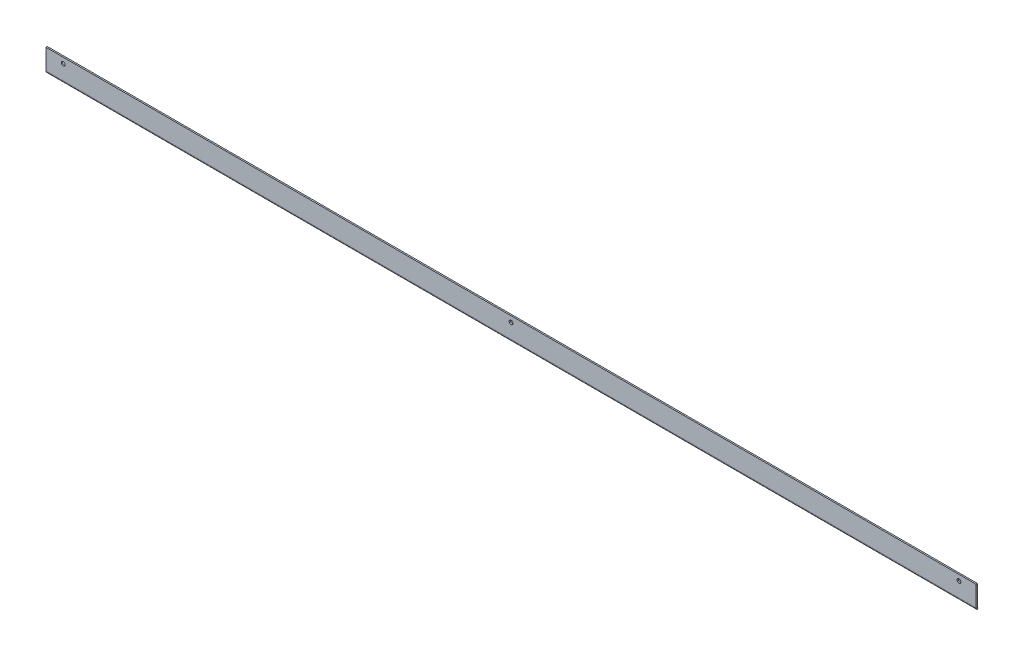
ISO-10303-21;
HEADER;
FILE_DESCRIPTION(('STEP AP214'),'2;1');
FILE_NAME('part.step','',(''),(''),'','','');
FILE_SCHEMA(('AUTOMOTIVE_DESIGN { 1 0 10303 214 1 1 1 1 }'));
ENDSEC;
DATA;
#1=APPLICATION_CONTEXT('core data for automotive mechanical design processes');
#2=APPLICATION_PROTOCOL_DEFINITION('international standard','automotive_design',2000,#1);
#3=PRODUCT_CONTEXT('',#1,'mechanical');
#4=PRODUCT('Part','Part','',(#3));
#5=PRODUCT_RELATED_PRODUCT_CATEGORY('part','',(#4));
#6=PRODUCT_DEFINITION_FORMATION('','',#4);
#7=PRODUCT_DEFINITION_CONTEXT('part definition',#1,'design');
#8=PRODUCT_DEFINITION('design','',#6,#7);
#9=PRODUCT_DEFINITION_SHAPE('','',#8);
#10=(LENGTH_UNIT() NAMED_UNIT(*) SI_UNIT(.MILLI.,.METRE.));
#11=(NAMED_UNIT(*) PLANE_ANGLE_UNIT() SI_UNIT($,.RADIAN.));
#12=(NAMED_UNIT(*) SI_UNIT($,.STERADIAN.) SOLID_ANGLE_UNIT());
#13=UNCERTAINTY_MEASURE_WITH_UNIT(LENGTH_MEASURE(1.E-05),#10,'distance_accuracy_value','');
#14=(GEOMETRIC_REPRESENTATION_CONTEXT(3) GLOBAL_UNCERTAINTY_ASSIGNED_CONTEXT((#13)) GLOBAL_UNIT_ASSIGNED_CONTEXT((#10,
#11,#12)) REPRESENTATION_CONTEXT('',''));
#15=CARTESIAN_POINT('',(0.,0.,0.));
#16=DIRECTION('',(0.,0.,1.));
#17=DIRECTION('',(1.,0.,0.));
#18=AXIS2_PLACEMENT_3D('',#15,#16,#17);
#19=CARTESIAN_POINT('',(405.9,-96.6000000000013,-1.00000000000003));
#20=DIRECTION('',(1.,0.,0.));
#21=DIRECTION('',(0.,0.,-1.));
#22=AXIS2_PLACEMENT_3D('',#19,#20,#21);
#23=PLANE('',#22);
#24=CARTESIAN_POINT('',(405.9,-96.6000000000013,-1.00000000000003));
#25=DIRECTION('',(-1.,0.,0.));
#26=DIRECTION('',(0.,0.,1.));
#27=AXIS2_PLACEMENT_3D('',#24,#25,#26);
#28=CIRCLE('',#27,2.19999999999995);
#29=CARTESIAN_POINT('',(405.9,-96.6000000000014,1.2));
#30=VERTEX_POINT('',#29);
#31=CARTESIAN_POINT('',(405.9,-98.4439088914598,0.200000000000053));
#32=VERTEX_POINT('',#31);
#33=EDGE_CURVE('E198',#30,#32,#28,.F.);
#34=ORIENTED_EDGE('',*,*,#33,.T.);
#35=DIRECTION('',(0.,-0.838140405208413,0.545454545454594));
#36=VECTOR('',#35,1.);
#37=CARTESIAN_POINT('',(405.9,-98.4439088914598,0.200000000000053));
#38=LINE('',#37,#36);
#39=CARTESIAN_POINT('',(405.9,-97.4381404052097,-0.454545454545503));
#40=VERTEX_POINT('',#39);
#41=EDGE_CURVE('E157',#32,#40,#38,.F.);
#42=ORIENTED_EDGE('',*,*,#41,.T.);
#43=CARTESIAN_POINT('',(405.9,-96.6000000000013,-1.00000000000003));
#44=DIRECTION('',(-1.,0.,0.));
#45=DIRECTION('',(0.,0.,1.));
#46=AXIS2_PLACEMENT_3D('',#43,#44,#45);
#47=CIRCLE('',#46,0.999999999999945);
#48=CARTESIAN_POINT('',(405.9,-96.6000000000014,0.));
#49=VERTEX_POINT('',#48);
#50=EDGE_CURVE('E204',#49,#40,#47,.F.);
#51=ORIENTED_EDGE('',*,*,#50,.F.);
#52=DIRECTION('',(0.,0.,1.));
#53=VECTOR('',#52,1.);
#54=CARTESIAN_POINT('',(405.9,-96.6000000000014,0.));
#55=LINE('',#54,#53);
#56=EDGE_CURVE('E211',#49,#30,#55,.T.);
#57=ORIENTED_EDGE('',*,*,#56,.T.);
#58=EDGE_LOOP('',(#34,#42,#51,#57));
#59=FACE_BOUND('',#58,.T.);
#60=ADVANCED_FACE('F61',(#59),#23,.T.);
#61=CARTESIAN_POINT('',(-406.9,-96.6000000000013,-0.999999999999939));
#62=DIRECTION('',(1.,0.,0.));
#63=DIRECTION('',(0.,0.,-1.));
#64=AXIS2_PLACEMENT_3D('',#61,#62,#63);
#65=PLANE('',#64);
#66=CARTESIAN_POINT('',(-406.9,-96.6000000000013,-0.999999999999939));
#67=DIRECTION('',(-1.,0.,0.));
#68=DIRECTION('',(0.,0.,1.));
#69=AXIS2_PLACEMENT_3D('',#66,#67,#68);
#70=CIRCLE('',#69,0.999999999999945);
#71=CARTESIAN_POINT('',(-406.9,-97.4381404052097,-0.454545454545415));
#72=VERTEX_POINT('',#71);
#73=CARTESIAN_POINT('',(-406.9,-96.6000000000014,0.));
#74=VERTEX_POINT('',#73);
#75=EDGE_CURVE('E209',#72,#74,#70,.T.);
#76=ORIENTED_EDGE('',*,*,#75,.F.);
#77=DIRECTION('',(0.,-0.838140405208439,0.545454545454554));
#78=VECTOR('',#77,1.);
#79=CARTESIAN_POINT('',(-406.9,-98.4439088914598,0.200000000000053));
#80=LINE('',#79,#78);
#81=CARTESIAN_POINT('',(-406.9,-98.4439088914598,0.200000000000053));
#82=VERTEX_POINT('',#81);
#83=EDGE_CURVE('E270',#82,#72,#80,.F.);
#84=ORIENTED_EDGE('',*,*,#83,.F.);
#85=CARTESIAN_POINT('',(-406.9,-96.6000000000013,-0.999999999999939));
#86=DIRECTION('',(-1.,0.,0.));
#87=DIRECTION('',(0.,0.,1.));
#88=AXIS2_PLACEMENT_3D('',#85,#86,#87);
#89=CIRCLE('',#88,2.19999999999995);
#90=CARTESIAN_POINT('',(-406.9,-96.6000000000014,1.20000000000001));
#91=VERTEX_POINT('',#90);
#92=EDGE_CURVE('E199',#82,#91,#89,.T.);
#93=ORIENTED_EDGE('',*,*,#92,.T.);
#94=DIRECTION('',(0.,0.,1.));
#95=VECTOR('',#94,1.);
#96=CARTESIAN_POINT('',(-406.9,-96.6000000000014,0.));
#97=LINE('',#96,#95);
#98=EDGE_CURVE('E202',#74,#91,#97,.T.);
#99=ORIENTED_EDGE('',*,*,#98,.F.);
#100=EDGE_LOOP('',(#76,#84,#93,#99));
#101=FACE_BOUND('',#100,.T.);
#102=ADVANCED_FACE('F312',(#101),#65,.F.);
#103=CARTESIAN_POINT('',(-406.9,-96.6000000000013,-0.999999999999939));
#104=DIRECTION('',(-1.,0.,0.));
#105=DIRECTION('',(0.,-1.,0.));
#106=AXIS2_PLACEMENT_3D('',#103,#104,#105);
#107=CYLINDRICAL_SURFACE('',#106,2.19999999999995);
#108=CARTESIAN_POINT('',(391.9,-96.6000000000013,-1.00000000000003));
#109=DIRECTION('',(-1.,0.,0.));
#110=DIRECTION('',(0.,-1.,0.));
#111=AXIS2_PLACEMENT_3D('',#108,#109,#110);
#112=CIRCLE('',#111,2.19999999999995);
#113=CARTESIAN_POINT('',(391.9,-98.4439088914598,0.200000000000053));
#114=VERTEX_POINT('',#113);
#115=CARTESIAN_POINT('',(391.9,-98.8000000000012,-0.999999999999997));
#116=VERTEX_POINT('',#115);
#117=EDGE_CURVE('E161',#114,#116,#112,.F.);
#118=ORIENTED_EDGE('',*,*,#117,.F.);
#119=DIRECTION('',(-1.,0.,0.));
#120=VECTOR('',#119,1.);
#121=CARTESIAN_POINT('',(-406.9,-98.4439088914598,0.200000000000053));
#122=LINE('',#121,#120);
#123=EDGE_CURVE('E169',#32,#114,#122,.T.);
#124=ORIENTED_EDGE('',*,*,#123,.F.);
#125=ORIENTED_EDGE('',*,*,#33,.F.);
#126=DIRECTION('',(-1.,0.,0.));
#127=VECTOR('',#126,1.);
#128=CARTESIAN_POINT('',(-406.9,-96.6000000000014,1.20000000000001));
#129=LINE('',#128,#127);
#130=EDGE_CURVE('E195',#91,#30,#129,.F.);
#131=ORIENTED_EDGE('',*,*,#130,.F.);
#132=ORIENTED_EDGE('',*,*,#92,.F.);
#133=DIRECTION('',(-1.,0.,0.));
#134=VECTOR('',#133,1.);
#135=CARTESIAN_POINT('',(-406.9,-98.4439088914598,0.200000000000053));
#136=LINE('',#135,#134);
#137=CARTESIAN_POINT('',(-392.9,-98.4439088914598,0.200000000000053));
#138=VERTEX_POINT('',#137);
#139=EDGE_CURVE('E262',#138,#82,#136,.T.);
#140=ORIENTED_EDGE('',*,*,#139,.F.);
#141=CARTESIAN_POINT('',(-392.9,-96.6000000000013,-0.99999999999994));
#142=DIRECTION('',(1.,0.,0.));
#143=DIRECTION('',(0.,1.,0.));
#144=AXIS2_PLACEMENT_3D('',#141,#142,#143);
#145=CIRCLE('',#144,2.19999999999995);
#146=CARTESIAN_POINT('',(-392.9,-98.8000000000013,-0.999999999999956));
#147=VERTEX_POINT('',#146);
#148=EDGE_CURVE('E184',#147,#138,#145,.F.);
#149=ORIENTED_EDGE('',*,*,#148,.F.);
#150=DIRECTION('',(-1.,0.,0.));
#151=VECTOR('',#150,1.);
#152=CARTESIAN_POINT('',(0.,-98.8000000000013,-0.999999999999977));
#153=LINE('',#152,#151);
#154=EDGE_CURVE('E176',#116,#147,#153,.T.);
#155=ORIENTED_EDGE('',*,*,#154,.F.);
#156=EDGE_LOOP('',(#118,#124,#125,#131,#132,#140,#149,#155));
#157=FACE_BOUND('',#156,.T.);
#158=ADVANCED_FACE('F182',(#157),#107,.T.);
#159=CARTESIAN_POINT('',(-406.9,-96.6000000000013,-0.999999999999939));
#160=DIRECTION('',(-1.,0.,0.));
#161=DIRECTION('',(0.,-1.,0.));
#162=AXIS2_PLACEMENT_3D('',#159,#160,#161);
#163=CYLINDRICAL_SURFACE('',#162,0.999999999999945);
#164=DIRECTION('',(-1.,0.,0.));
#165=VECTOR('',#164,1.);
#166=CARTESIAN_POINT('',(-406.9,-97.4381404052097,-0.454545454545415));
#167=LINE('',#166,#165);
#168=CARTESIAN_POINT('',(391.9,-97.4381404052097,-0.454545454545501));
#169=VERTEX_POINT('',#168);
#170=EDGE_CURVE('E168',#40,#169,#167,.T.);
#171=ORIENTED_EDGE('',*,*,#170,.T.);
#172=CARTESIAN_POINT('',(391.9,-96.6000000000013,-1.00000000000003));
#173=DIRECTION('',(-1.,0.,0.));
#174=DIRECTION('',(0.,0.,1.));
#175=AXIS2_PLACEMENT_3D('',#172,#173,#174);
#176=CIRCLE('',#175,0.999999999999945);
#177=CARTESIAN_POINT('',(391.9,-97.6000000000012,-1.00000000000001));
#178=VERTEX_POINT('',#177);
#179=EDGE_CURVE('E254',#169,#178,#176,.F.);
#180=ORIENTED_EDGE('',*,*,#179,.T.);
#181=DIRECTION('',(1.,0.,0.));
#182=VECTOR('',#181,1.);
#183=CARTESIAN_POINT('',(405.9,-97.6000000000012,-1.));
#184=LINE('',#183,#182);
#185=CARTESIAN_POINT('',(-392.9,-97.6000000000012,-0.999999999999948));
#186=VERTEX_POINT('',#185);
#187=EDGE_CURVE('E186',#178,#186,#184,.F.);
#188=ORIENTED_EDGE('',*,*,#187,.T.);
#189=CARTESIAN_POINT('',(-392.9,-96.6000000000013,-0.99999999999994));
#190=DIRECTION('',(-1.,0.,0.));
#191=DIRECTION('',(0.,0.,1.));
#192=AXIS2_PLACEMENT_3D('',#189,#190,#191);
#193=CIRCLE('',#192,0.999999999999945);
#194=CARTESIAN_POINT('',(-392.9,-97.4381404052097,-0.454545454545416));
#195=VERTEX_POINT('',#194);
#196=EDGE_CURVE('E258',#186,#195,#193,.T.);
#197=ORIENTED_EDGE('',*,*,#196,.T.);
#198=DIRECTION('',(-1.,0.,0.));
#199=VECTOR('',#198,1.);
#200=CARTESIAN_POINT('',(-406.9,-97.4381404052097,-0.454545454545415));
#201=LINE('',#200,#199);
#202=EDGE_CURVE('E261',#195,#72,#201,.T.);
#203=ORIENTED_EDGE('',*,*,#202,.T.);
#204=ORIENTED_EDGE('',*,*,#75,.T.);
#205=DIRECTION('',(-1.,0.,0.));
#206=VECTOR('',#205,1.);
#207=CARTESIAN_POINT('',(-406.9,-96.6000000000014,0.));
#208=LINE('',#207,#206);
#209=EDGE_CURVE('E207',#74,#49,#208,.F.);
#210=ORIENTED_EDGE('',*,*,#209,.T.);
#211=ORIENTED_EDGE('',*,*,#50,.T.);
#212=EDGE_LOOP('',(#171,#180,#188,#197,#203,#204,#210,#211));
#213=FACE_BOUND('',#212,.T.);
#214=ADVANCED_FACE('F246',(#213),#163,.F.);
#215=CARTESIAN_POINT('',(0.,-98.8000000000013,3.02260524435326E-13));
#216=DIRECTION('',(0.,-1.,0.));
#217=DIRECTION('',(0.,0.,-1.));
#218=AXIS2_PLACEMENT_3D('',#215,#216,#217);
#219=PLANE('',#218);
#220=DIRECTION('',(-1.,0.,0.));
#221=VECTOR('',#220,1.);
#222=CARTESIAN_POINT('',(-406.9,-98.8000000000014,-13.8));
#223=LINE('',#222,#221);
#224=CARTESIAN_POINT('',(391.9,-98.8000000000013,-13.8));
#225=VERTEX_POINT('',#224);
#226=CARTESIAN_POINT('',(-392.9,-98.8000000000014,-13.8));
#227=VERTEX_POINT('',#226);
#228=EDGE_CURVE('E178',#225,#227,#223,.T.);
#229=ORIENTED_EDGE('',*,*,#228,.F.);
#230=DIRECTION('',(0.,0.,1.));
#231=VECTOR('',#230,1.);
#232=CARTESIAN_POINT('',(391.9,-98.8000000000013,-13.8));
#233=LINE('',#232,#231);
#234=EDGE_CURVE('E76',#225,#116,#233,.T.);
#235=ORIENTED_EDGE('',*,*,#234,.T.);
#236=ORIENTED_EDGE('',*,*,#154,.T.);
#237=DIRECTION('',(0.,0.,-1.));
#238=VECTOR('',#237,1.);
#239=CARTESIAN_POINT('',(-392.9,-98.8000000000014,-7.39999999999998));
#240=LINE('',#239,#238);
#241=EDGE_CURVE('E156',#227,#147,#240,.F.);
#242=ORIENTED_EDGE('',*,*,#241,.F.);
#243=EDGE_LOOP('',(#229,#235,#236,#242));
#244=FACE_BOUND('',#243,.T.);
#245=ADVANCED_FACE('F174',(#244),#219,.T.);
#246=CARTESIAN_POINT('',(0.,-97.6000000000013,2.98070746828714E-13));
#247=DIRECTION('',(0.,-1.,0.));
#248=DIRECTION('',(0.,0.,-1.));
#249=AXIS2_PLACEMENT_3D('',#246,#247,#248);
#250=PLANE('',#249);
#251=DIRECTION('',(0.,0.,1.));
#252=VECTOR('',#251,1.);
#253=CARTESIAN_POINT('',(391.9,-97.6000000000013,-7.4));
#254=LINE('',#253,#252);
#255=CARTESIAN_POINT('',(391.9,-97.6000000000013,-13.8));
#256=VERTEX_POINT('',#255);
#257=EDGE_CURVE('E153',#256,#178,#254,.T.);
#258=ORIENTED_EDGE('',*,*,#257,.F.);
#259=DIRECTION('',(1.,0.,0.));
#260=VECTOR('',#259,1.);
#261=CARTESIAN_POINT('',(0.,-97.6000000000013,-13.8));
#262=LINE('',#261,#260);
#263=CARTESIAN_POINT('',(-392.9,-97.6000000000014,-13.8));
#264=VERTEX_POINT('',#263);
#265=EDGE_CURVE('E185',#256,#264,#262,.F.);
#266=ORIENTED_EDGE('',*,*,#265,.T.);
#267=DIRECTION('',(0.,0.,1.));
#268=VECTOR('',#267,1.);
#269=CARTESIAN_POINT('',(-392.9,-97.6000000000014,-13.8));
#270=LINE('',#269,#268);
#271=EDGE_CURVE('E84',#264,#186,#270,.T.);
#272=ORIENTED_EDGE('',*,*,#271,.T.);
#273=ORIENTED_EDGE('',*,*,#187,.F.);
#274=EDGE_LOOP('',(#258,#266,#272,#273));
#275=FACE_BOUND('',#274,.T.);
#276=ADVANCED_FACE('F302',(#275),#250,.F.);
#277=CARTESIAN_POINT('',(-406.9,-98.8000000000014,-13.8));
#278=DIRECTION('',(0.,0.,-1.));
#279=DIRECTION('',(0.,1.,0.));
#280=AXIS2_PLACEMENT_3D('',#277,#278,#279);
#281=PLANE('',#280);
#282=ORIENTED_EDGE('',*,*,#265,.F.);
#283=DIRECTION('',(0.,1.,0.));
#284=VECTOR('',#283,1.);
#285=CARTESIAN_POINT('',(391.9,-98.8000000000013,-13.8));
#286=LINE('',#285,#284);
#287=EDGE_CURVE('E179',#256,#225,#286,.F.);
#288=ORIENTED_EDGE('',*,*,#287,.T.);
#289=ORIENTED_EDGE('',*,*,#228,.T.);
#290=DIRECTION('',(0.,-1.,0.));
#291=VECTOR('',#290,1.);
#292=CARTESIAN_POINT('',(-392.9,-97.6000000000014,-13.8));
#293=LINE('',#292,#291);
#294=EDGE_CURVE('E266',#227,#264,#293,.F.);
#295=ORIENTED_EDGE('',*,*,#294,.T.);
#296=EDGE_LOOP('',(#282,#288,#289,#295));
#297=FACE_BOUND('',#296,.T.);
#298=ADVANCED_FACE('F292',(#297),#281,.T.);
#299=CARTESIAN_POINT('',(405.9,-98.8000000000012,1.2));
#300=DIRECTION('',(-1.,0.,0.));
#301=DIRECTION('',(0.,0.,1.));
#302=AXIS2_PLACEMENT_3D('',#299,#300,#301);
#303=PLANE('',#302);
#304=ORIENTED_EDGE('',*,*,#56,.F.);
#305=DIRECTION('',(0.,1.,0.));
#306=VECTOR('',#305,1.);
#307=CARTESIAN_POINT('',(405.9,-98.8000000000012,0.));
#308=LINE('',#307,#306);
#309=CARTESIAN_POINT('',(405.9,-78.8000000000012,0.));
#310=VERTEX_POINT('',#309);
#311=EDGE_CURVE('E214',#49,#310,#308,.T.);
#312=ORIENTED_EDGE('',*,*,#311,.T.);
#313=DIRECTION('',(0.,0.,-1.));
#314=VECTOR('',#313,1.);
#315=CARTESIAN_POINT('',(405.9,-78.8000000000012,1.2));
#316=LINE('',#315,#314);
#317=CARTESIAN_POINT('',(405.9,-78.8000000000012,1.2));
#318=VERTEX_POINT('',#317);
#319=EDGE_CURVE('E13',#318,#310,#316,.T.);
#320=ORIENTED_EDGE('',*,*,#319,.F.);
#321=DIRECTION('',(0.,1.,0.));
#322=VECTOR('',#321,1.);
#323=CARTESIAN_POINT('',(405.9,-98.8000000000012,1.2));
#324=LINE('',#323,#322);
#325=EDGE_CURVE('E217',#30,#318,#324,.T.);
#326=ORIENTED_EDGE('',*,*,#325,.F.);
#327=EDGE_LOOP('',(#304,#312,#320,#326));
#328=FACE_BOUND('',#327,.T.);
#329=ADVANCED_FACE('F63',(#328),#303,.F.);
#330=CARTESIAN_POINT('',(-406.9,-98.8000000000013,1.2));
#331=DIRECTION('',(1.,0.,0.));
#332=DIRECTION('',(0.,1.,0.));
#333=AXIS2_PLACEMENT_3D('',#330,#331,#332);
#334=PLANE('',#333);
#335=ORIENTED_EDGE('',*,*,#98,.T.);
#336=DIRECTION('',(0.,-1.,0.));
#337=VECTOR('',#336,1.);
#338=CARTESIAN_POINT('',(-406.9,-98.8000000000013,1.2));
#339=LINE('',#338,#337);
#340=CARTESIAN_POINT('',(-406.9,-78.8000000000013,1.2));
#341=VERTEX_POINT('',#340);
#342=EDGE_CURVE('E222',#341,#91,#339,.T.);
#343=ORIENTED_EDGE('',*,*,#342,.F.);
#344=DIRECTION('',(0.,0.,-1.));
#345=VECTOR('',#344,1.);
#346=CARTESIAN_POINT('',(-406.9,-78.8000000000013,1.2));
#347=LINE('',#346,#345);
#348=CARTESIAN_POINT('',(-406.9,-78.8000000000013,0.));
#349=VERTEX_POINT('',#348);
#350=EDGE_CURVE('E69',#341,#349,#347,.T.);
#351=ORIENTED_EDGE('',*,*,#350,.T.);
#352=DIRECTION('',(0.,-1.,0.));
#353=VECTOR('',#352,1.);
#354=CARTESIAN_POINT('',(-406.9,-98.8000000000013,0.));
#355=LINE('',#354,#353);
#356=EDGE_CURVE('E220',#349,#74,#355,.T.);
#357=ORIENTED_EDGE('',*,*,#356,.T.);
#358=EDGE_LOOP('',(#335,#343,#351,#357));
#359=FACE_BOUND('',#358,.T.);
#360=ADVANCED_FACE('F234',(#359),#334,.F.);
#361=CARTESIAN_POINT('',(0.,0.,1.2));
#362=DIRECTION('',(0.,0.,1.));
#363=DIRECTION('',(1.,0.,0.));
#364=AXIS2_PLACEMENT_3D('',#361,#362,#363);
#365=PLANE('',#364);
#366=CARTESIAN_POINT('',(390.9,-83.8000000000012,1.2));
#367=DIRECTION('',(0.,0.,1.));
#368=DIRECTION('',(1.,0.,0.));
#369=AXIS2_PLACEMENT_3D('',#366,#367,#368);
#370=CIRCLE('',#369,1.65000000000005);
#371=CARTESIAN_POINT('',(392.55,-83.8000000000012,1.2));
#372=VERTEX_POINT('',#371);
#373=EDGE_CURVE('E277',#372,#372,#370,.T.);
#374=ORIENTED_EDGE('',*,*,#373,.F.);
#375=EDGE_LOOP('',(#374));
#376=FACE_BOUND('',#375,.T.);
#377=CARTESIAN_POINT('',(-0.499999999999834,-83.8000000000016,1.2));
#378=DIRECTION('',(0.,0.,1.));
#379=DIRECTION('',(1.,0.,0.));
#380=AXIS2_PLACEMENT_3D('',#377,#378,#379);
#381=CIRCLE('',#380,1.65000000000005);
#382=CARTESIAN_POINT('',(1.15000000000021,-83.8000000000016,1.2));
#383=VERTEX_POINT('',#382);
#384=EDGE_CURVE('E283',#383,#383,#381,.T.);
#385=ORIENTED_EDGE('',*,*,#384,.F.);
#386=EDGE_LOOP('',(#385));
#387=FACE_BOUND('',#386,.T.);
#388=CARTESIAN_POINT('',(-391.9,-83.8000000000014,1.2));
#389=DIRECTION('',(0.,0.,1.));
#390=DIRECTION('',(1.,0.,0.));
#391=AXIS2_PLACEMENT_3D('',#388,#389,#390);
#392=CIRCLE('',#391,1.65000000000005);
#393=CARTESIAN_POINT('',(-390.25,-83.8000000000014,1.2));
#394=VERTEX_POINT('',#393);
#395=EDGE_CURVE('E272',#394,#394,#392,.T.);
#396=ORIENTED_EDGE('',*,*,#395,.F.);
#397=EDGE_LOOP('',(#396));
#398=FACE_BOUND('',#397,.T.);
#399=ORIENTED_EDGE('',*,*,#342,.T.);
#400=ORIENTED_EDGE('',*,*,#130,.T.);
#401=ORIENTED_EDGE('',*,*,#325,.T.);
#402=DIRECTION('',(-1.,0.,0.));
#403=VECTOR('',#402,1.);
#404=CARTESIAN_POINT('',(405.9,-78.8000000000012,1.2));
#405=LINE('',#404,#403);
#406=EDGE_CURVE('E219',#318,#341,#405,.T.);
#407=ORIENTED_EDGE('',*,*,#406,.T.);
#408=EDGE_LOOP('',(#399,#400,#401,#407));
#409=FACE_BOUND('',#408,.T.);
#410=ADVANCED_FACE('F322',(#376,#387,#398,#409),#365,.T.);
#411=CARTESIAN_POINT('',(0.,0.,0.));
#412=DIRECTION('',(0.,0.,1.));
#413=DIRECTION('',(1.,0.,0.));
#414=AXIS2_PLACEMENT_3D('',#411,#412,#413);
#415=PLANE('',#414);
#416=CARTESIAN_POINT('',(390.9,-83.8000000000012,0.));
#417=DIRECTION('',(0.,0.,1.));
#418=DIRECTION('',(1.,0.,0.));
#419=AXIS2_PLACEMENT_3D('',#416,#417,#418);
#420=CIRCLE('',#419,1.65000000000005);
#421=CARTESIAN_POINT('',(392.55,-83.8000000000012,0.));
#422=VERTEX_POINT('',#421);
#423=EDGE_CURVE('E191',#422,#422,#420,.T.);
#424=ORIENTED_EDGE('',*,*,#423,.T.);
#425=EDGE_LOOP('',(#424));
#426=FACE_BOUND('',#425,.T.);
#427=CARTESIAN_POINT('',(-0.499999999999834,-83.8000000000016,0.));
#428=DIRECTION('',(0.,0.,1.));
#429=DIRECTION('',(1.,0.,0.));
#430=AXIS2_PLACEMENT_3D('',#427,#428,#429);
#431=CIRCLE('',#430,1.65000000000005);
#432=CARTESIAN_POINT('',(1.15000000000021,-83.8000000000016,0.));
#433=VERTEX_POINT('',#432);
#434=EDGE_CURVE('E280',#433,#433,#431,.T.);
#435=ORIENTED_EDGE('',*,*,#434,.T.);
#436=EDGE_LOOP('',(#435));
#437=FACE_BOUND('',#436,.T.);
#438=CARTESIAN_POINT('',(-391.9,-83.8000000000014,0.));
#439=DIRECTION('',(0.,0.,1.));
#440=DIRECTION('',(1.,0.,0.));
#441=AXIS2_PLACEMENT_3D('',#438,#439,#440);
#442=CIRCLE('',#441,1.65000000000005);
#443=CARTESIAN_POINT('',(-390.25,-83.8000000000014,0.));
#444=VERTEX_POINT('',#443);
#445=EDGE_CURVE('E286',#444,#444,#442,.T.);
#446=ORIENTED_EDGE('',*,*,#445,.T.);
#447=EDGE_LOOP('',(#446));
#448=FACE_BOUND('',#447,.T.);
#449=ORIENTED_EDGE('',*,*,#209,.F.);
#450=ORIENTED_EDGE('',*,*,#356,.F.);
#451=DIRECTION('',(-1.,0.,0.));
#452=VECTOR('',#451,1.);
#453=CARTESIAN_POINT('',(405.9,-78.8000000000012,0.));
#454=LINE('',#453,#452);
#455=EDGE_CURVE('E226',#310,#349,#454,.T.);
#456=ORIENTED_EDGE('',*,*,#455,.F.);
#457=ORIENTED_EDGE('',*,*,#311,.F.);
#458=EDGE_LOOP('',(#449,#450,#456,#457));
#459=FACE_BOUND('',#458,.T.);
#460=ADVANCED_FACE('F240',(#426,#437,#448,#459),#415,.F.);
#461=CARTESIAN_POINT('',(405.9,-78.8000000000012,1.2));
#462=DIRECTION('',(0.,-1.,0.));
#463=DIRECTION('',(1.,0.,0.));
#464=AXIS2_PLACEMENT_3D('',#461,#462,#463);
#465=PLANE('',#464);
#466=ORIENTED_EDGE('',*,*,#455,.T.);
#467=ORIENTED_EDGE('',*,*,#350,.F.);
#468=ORIENTED_EDGE('',*,*,#406,.F.);
#469=ORIENTED_EDGE('',*,*,#319,.T.);
#470=EDGE_LOOP('',(#466,#467,#468,#469));
#471=FACE_BOUND('',#470,.T.);
#472=ADVANCED_FACE('F328',(#471),#465,.F.);
#473=CARTESIAN_POINT('',(-391.9,-83.8000000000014,0.));
#474=DIRECTION('',(0.,0.,1.));
#475=DIRECTION('',(1.,0.,0.));
#476=AXIS2_PLACEMENT_3D('',#473,#474,#475);
#477=CYLINDRICAL_SURFACE('',#476,1.65000000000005);
#478=ORIENTED_EDGE('',*,*,#445,.F.);
#479=EDGE_LOOP('',(#478));
#480=FACE_BOUND('',#479,.T.);
#481=ORIENTED_EDGE('',*,*,#395,.T.);
#482=EDGE_LOOP('',(#481));
#483=FACE_BOUND('',#482,.T.);
#484=ADVANCED_FACE('F332',(#480,#483),#477,.F.);
#485=CARTESIAN_POINT('',(-0.499999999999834,-83.8000000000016,0.));
#486=DIRECTION('',(0.,0.,1.));
#487=DIRECTION('',(1.,0.,0.));
#488=AXIS2_PLACEMENT_3D('',#485,#486,#487);
#489=CYLINDRICAL_SURFACE('',#488,1.65000000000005);
#490=ORIENTED_EDGE('',*,*,#434,.F.);
#491=EDGE_LOOP('',(#490));
#492=FACE_BOUND('',#491,.T.);
#493=ORIENTED_EDGE('',*,*,#384,.T.);
#494=EDGE_LOOP('',(#493));
#495=FACE_BOUND('',#494,.T.);
#496=ADVANCED_FACE('F336',(#492,#495),#489,.F.);
#497=CARTESIAN_POINT('',(390.9,-83.8000000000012,0.));
#498=DIRECTION('',(0.,0.,1.));
#499=DIRECTION('',(1.,0.,0.));
#500=AXIS2_PLACEMENT_3D('',#497,#498,#499);
#501=CYLINDRICAL_SURFACE('',#500,1.65000000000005);
#502=ORIENTED_EDGE('',*,*,#423,.F.);
#503=EDGE_LOOP('',(#502));
#504=FACE_BOUND('',#503,.T.);
#505=ORIENTED_EDGE('',*,*,#373,.T.);
#506=EDGE_LOOP('',(#505));
#507=FACE_BOUND('',#506,.T.);
#508=ADVANCED_FACE('F367',(#504,#507),#501,.F.);
#509=CARTESIAN_POINT('',(-392.9,-96.6000000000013,-0.99999999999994));
#510=DIRECTION('',(-1.,0.,0.));
#511=DIRECTION('',(0.,-1.,0.));
#512=AXIS2_PLACEMENT_3D('',#509,#510,#511);
#513=PLANE('',#512);
#514=DIRECTION('',(0.,-1.,0.));
#515=VECTOR('',#514,1.);
#516=CARTESIAN_POINT('',(-392.9,-98.8000000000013,-0.999999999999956));
#517=LINE('',#516,#515);
#518=EDGE_CURVE('E268',#147,#186,#517,.F.);
#519=ORIENTED_EDGE('',*,*,#518,.F.);
#520=ORIENTED_EDGE('',*,*,#148,.T.);
#521=DIRECTION('',(0.,-0.838140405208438,0.545454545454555));
#522=VECTOR('',#521,1.);
#523=CARTESIAN_POINT('',(-392.9,-98.4439088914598,0.200000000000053));
#524=LINE('',#523,#522);
#525=EDGE_CURVE('E264',#138,#195,#524,.F.);
#526=ORIENTED_EDGE('',*,*,#525,.T.);
#527=ORIENTED_EDGE('',*,*,#196,.F.);
#528=EDGE_LOOP('',(#519,#520,#526,#527));
#529=FACE_BOUND('',#528,.T.);
#530=ADVANCED_FACE('F351',(#529),#513,.T.);
#531=CARTESIAN_POINT('',(-399.9,-98.4439088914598,0.200000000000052));
#532=DIRECTION('',(0.,0.545454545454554,0.838140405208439));
#533=DIRECTION('',(-1.,0.,0.));
#534=AXIS2_PLACEMENT_3D('',#531,#532,#533);
#535=PLANE('',#534);
#536=ORIENTED_EDGE('',*,*,#139,.T.);
#537=ORIENTED_EDGE('',*,*,#83,.T.);
#538=ORIENTED_EDGE('',*,*,#202,.F.);
#539=ORIENTED_EDGE('',*,*,#525,.F.);
#540=EDGE_LOOP('',(#536,#537,#538,#539));
#541=FACE_BOUND('',#540,.T.);
#542=ADVANCED_FACE('F347',(#541),#535,.F.);
#543=CARTESIAN_POINT('',(-392.9,-97.6000000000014,-13.8));
#544=DIRECTION('',(1.,0.,0.));
#545=DIRECTION('',(0.,0.,1.));
#546=AXIS2_PLACEMENT_3D('',#543,#544,#545);
#547=PLANE('',#546);
#548=ORIENTED_EDGE('',*,*,#294,.F.);
#549=ORIENTED_EDGE('',*,*,#241,.T.);
#550=ORIENTED_EDGE('',*,*,#518,.T.);
#551=ORIENTED_EDGE('',*,*,#271,.F.);
#552=EDGE_LOOP('',(#548,#549,#550,#551));
#553=FACE_BOUND('',#552,.T.);
#554=ADVANCED_FACE('F352',(#553),#547,.F.);
#555=CARTESIAN_POINT('',(398.9,-98.4439088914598,0.199999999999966));
#556=DIRECTION('',(0.,0.545454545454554,0.838140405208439));
#557=DIRECTION('',(-1.,0.,0.));
#558=AXIS2_PLACEMENT_3D('',#555,#556,#557);
#559=PLANE('',#558);
#560=ORIENTED_EDGE('',*,*,#41,.F.);
#561=ORIENTED_EDGE('',*,*,#123,.T.);
#562=DIRECTION('',(0.,-0.838140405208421,0.545454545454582));
#563=VECTOR('',#562,1.);
#564=CARTESIAN_POINT('',(391.9,-98.4439088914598,0.200000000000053));
#565=LINE('',#564,#563);
#566=EDGE_CURVE('E164',#114,#169,#565,.F.);
#567=ORIENTED_EDGE('',*,*,#566,.T.);
#568=ORIENTED_EDGE('',*,*,#170,.F.);
#569=EDGE_LOOP('',(#560,#561,#567,#568));
#570=FACE_BOUND('',#569,.T.);
#571=ADVANCED_FACE('F354',(#570),#559,.F.);
#572=CARTESIAN_POINT('',(391.9,-96.6000000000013,-1.00000000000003));
#573=DIRECTION('',(1.,0.,0.));
#574=DIRECTION('',(0.,1.,0.));
#575=AXIS2_PLACEMENT_3D('',#572,#573,#574);
#576=PLANE('',#575);
#577=ORIENTED_EDGE('',*,*,#117,.T.);
#578=DIRECTION('',(0.,-1.,0.));
#579=VECTOR('',#578,1.);
#580=CARTESIAN_POINT('',(391.9,-98.8000000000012,-0.999999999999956));
#581=LINE('',#580,#579);
#582=EDGE_CURVE('E149',#116,#178,#581,.F.);
#583=ORIENTED_EDGE('',*,*,#582,.T.);
#584=ORIENTED_EDGE('',*,*,#179,.F.);
#585=ORIENTED_EDGE('',*,*,#566,.F.);
#586=EDGE_LOOP('',(#577,#583,#584,#585));
#587=FACE_BOUND('',#586,.T.);
#588=ADVANCED_FACE('F162',(#587),#576,.T.);
#589=CARTESIAN_POINT('',(391.9,-98.8000000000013,-13.8));
#590=DIRECTION('',(-1.,0.,0.));
#591=DIRECTION('',(0.,0.,1.));
#592=AXIS2_PLACEMENT_3D('',#589,#590,#591);
#593=PLANE('',#592);
#594=ORIENTED_EDGE('',*,*,#287,.F.);
#595=ORIENTED_EDGE('',*,*,#257,.T.);
#596=ORIENTED_EDGE('',*,*,#582,.F.);
#597=ORIENTED_EDGE('',*,*,#234,.F.);
#598=EDGE_LOOP('',(#594,#595,#596,#597));
#599=FACE_BOUND('',#598,.T.);
#600=ADVANCED_FACE('F151',(#599),#593,.F.);
#601=CLOSED_SHELL('',(#60,#102,#158,#214,#245,#276,#298,#329,#360,#410,#460,#472,#484,#496,#508,
#530,#542,#554,#571,#588,#600));
#602=MANIFOLD_SOLID_BREP('B2',#601);
#603=ADVANCED_BREP_SHAPE_REPRESENTATION('',(#18,#602),#14);
#604=SHAPE_DEFINITION_REPRESENTATION(#9,#603);
ENDSEC;
END-ISO-10303-21;
